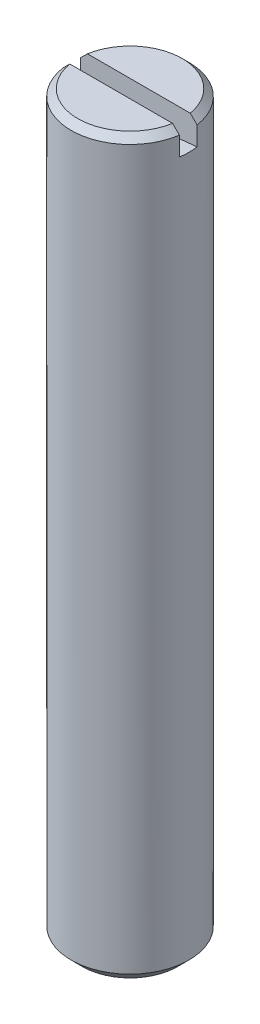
ISO-10303-21;
HEADER;
FILE_DESCRIPTION(('STEP AP214'),'2;1');
FILE_NAME('part.step','',(''),(''),'','','');
FILE_SCHEMA(('AUTOMOTIVE_DESIGN { 1 0 10303 214 1 1 1 1 }'));
ENDSEC;
DATA;
#1=APPLICATION_CONTEXT('core data for automotive mechanical design processes');
#2=APPLICATION_PROTOCOL_DEFINITION('international standard','automotive_design',2000,#1);
#3=PRODUCT_CONTEXT('',#1,'mechanical');
#4=PRODUCT('Part','Part','',(#3));
#5=PRODUCT_RELATED_PRODUCT_CATEGORY('part','',(#4));
#6=PRODUCT_DEFINITION_FORMATION('','',#4);
#7=PRODUCT_DEFINITION_CONTEXT('part definition',#1,'design');
#8=PRODUCT_DEFINITION('design','',#6,#7);
#9=PRODUCT_DEFINITION_SHAPE('','',#8);
#10=(LENGTH_UNIT() NAMED_UNIT(*) SI_UNIT(.MILLI.,.METRE.));
#11=(NAMED_UNIT(*) PLANE_ANGLE_UNIT() SI_UNIT($,.RADIAN.));
#12=(NAMED_UNIT(*) SI_UNIT($,.STERADIAN.) SOLID_ANGLE_UNIT());
#13=UNCERTAINTY_MEASURE_WITH_UNIT(LENGTH_MEASURE(1.E-05),#10,'distance_accuracy_value','');
#14=(GEOMETRIC_REPRESENTATION_CONTEXT(3) GLOBAL_UNCERTAINTY_ASSIGNED_CONTEXT((#13)) GLOBAL_UNIT_ASSIGNED_CONTEXT((#10,
#11,#12)) REPRESENTATION_CONTEXT('',''));
#15=CARTESIAN_POINT('',(0.,0.,0.));
#16=DIRECTION('',(0.,0.,1.));
#17=DIRECTION('',(1.,0.,0.));
#18=AXIS2_PLACEMENT_3D('',#15,#16,#17);
#19=CARTESIAN_POINT('',(0.,79.5,0.6));
#20=DIRECTION('',(0.,0.,-1.));
#21=DIRECTION('',(-1.,0.,0.));
#22=AXIS2_PLACEMENT_3D('',#19,#20,#21);
#23=CYLINDRICAL_SURFACE('',#22,31.5);
#24=CARTESIAN_POINT('',(3.95474398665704,48.2492400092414,-0.6));
#25=CARTESIAN_POINT('',(3.96984984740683,48.2511544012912,-0.500484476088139));
#26=CARTESIAN_POINT('',(3.98118553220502,48.2525972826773,-0.40038868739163));
#27=CARTESIAN_POINT('',(3.9962389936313,48.2545175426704,-0.20019306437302));
#28=CARTESIAN_POINT('',(4.,48.2550004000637,-0.10009653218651));
#29=CARTESIAN_POINT('',(4.,48.2550004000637,0.10009653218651));
#30=CARTESIAN_POINT('',(3.9962389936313,48.2545175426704,0.20019306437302));
#31=CARTESIAN_POINT('',(3.98118553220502,48.2525972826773,0.40038868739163));
#32=CARTESIAN_POINT('',(3.96984984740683,48.2511544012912,0.500484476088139));
#33=CARTESIAN_POINT('',(3.95474398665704,48.2492400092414,0.6));
#34=B_SPLINE_CURVE_WITH_KNOTS('',3,(#24,#25,#26,#27,#28,#29,#30,#31,#32,#33),.UNSPECIFIED.,.F.,
.F.,(4,2,2,2,4),(0.,0.301946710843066,0.602165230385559,0.902383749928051,1.20433046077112),.UNSPECIFIED.);
#35=CARTESIAN_POINT('',(3.95474398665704,48.2492400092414,-0.6));
#36=VERTEX_POINT('',#35);
#37=CARTESIAN_POINT('',(3.95474398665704,48.2492400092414,0.6));
#38=VERTEX_POINT('',#37);
#39=EDGE_CURVE('E82',#36,#38,#34,.T.);
#40=ORIENTED_EDGE('',*,*,#39,.F.);
#41=CARTESIAN_POINT('',(0.,79.5,-0.6));
#42=DIRECTION('',(0.,0.,-1.));
#43=DIRECTION('',(-1.,0.,0.));
#44=AXIS2_PLACEMENT_3D('',#41,#42,#43);
#45=CIRCLE('',#44,31.5);
#46=CARTESIAN_POINT('',(-3.95474398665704,48.2492400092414,-0.6));
#47=VERTEX_POINT('',#46);
#48=EDGE_CURVE('E88',#47,#36,#45,.F.);
#49=ORIENTED_EDGE('',*,*,#48,.F.);
#50=CARTESIAN_POINT('',(-3.95474398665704,48.2492400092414,0.6));
#51=CARTESIAN_POINT('',(-3.96984984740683,48.2511544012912,0.500484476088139));
#52=CARTESIAN_POINT('',(-3.98118553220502,48.2525972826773,0.40038868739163));
#53=CARTESIAN_POINT('',(-3.9962389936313,48.2545175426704,0.20019306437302));
#54=CARTESIAN_POINT('',(-4.,48.2550004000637,0.10009653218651));
#55=CARTESIAN_POINT('',(-4.,48.2550004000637,-0.10009653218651));
#56=CARTESIAN_POINT('',(-3.9962389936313,48.2545175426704,-0.20019306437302));
#57=CARTESIAN_POINT('',(-3.98118553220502,48.2525972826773,-0.40038868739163));
#58=CARTESIAN_POINT('',(-3.96984984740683,48.2511544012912,-0.500484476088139));
#59=CARTESIAN_POINT('',(-3.95474398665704,48.2492400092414,-0.6));
#60=B_SPLINE_CURVE_WITH_KNOTS('',3,(#50,#51,#52,#53,#54,#55,#56,#57,#58,#59),.UNSPECIFIED.,.F.,
.F.,(4,2,2,2,4),(0.,0.301946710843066,0.602165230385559,0.902383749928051,1.20433046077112),.UNSPECIFIED.);
#61=CARTESIAN_POINT('',(-3.95474398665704,48.2492400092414,0.6));
#62=VERTEX_POINT('',#61);
#63=EDGE_CURVE('E19',#62,#47,#60,.T.);
#64=ORIENTED_EDGE('',*,*,#63,.F.);
#65=CARTESIAN_POINT('',(0.,79.5,0.6));
#66=DIRECTION('',(0.,0.,-1.));
#67=DIRECTION('',(-1.,0.,0.));
#68=AXIS2_PLACEMENT_3D('',#65,#66,#67);
#69=CIRCLE('',#68,31.5);
#70=EDGE_CURVE('E81',#62,#38,#69,.F.);
#71=ORIENTED_EDGE('',*,*,#70,.T.);
#72=EDGE_LOOP('',(#40,#49,#64,#71));
#73=FACE_BOUND('',#72,.T.);
#74=ADVANCED_FACE('F15',(#73),#23,.F.);
#75=CARTESIAN_POINT('',(0.,79.5,0.6));
#76=DIRECTION('',(0.,0.,1.));
#77=DIRECTION('',(1.,0.,0.));
#78=AXIS2_PLACEMENT_3D('',#75,#76,#77);
#79=PLANE('',#78);
#80=DIRECTION('',(1.,0.,0.));
#81=VECTOR('',#80,1.);
#82=CARTESIAN_POINT('',(0.,50.,0.6));
#83=LINE('',#82,#81);
#84=CARTESIAN_POINT('',(-3.48878202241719,50.0000000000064,0.6));
#85=VERTEX_POINT('',#84);
#86=CARTESIAN_POINT('',(3.48878202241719,50.0000000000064,0.6));
#87=VERTEX_POINT('',#86);
#88=EDGE_CURVE('E157',#85,#87,#83,.T.);
#89=ORIENTED_EDGE('',*,*,#88,.T.);
#90=CARTESIAN_POINT('',(3.95474398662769,49.5399999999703,0.6));
#91=CARTESIAN_POINT('',(3.87714466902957,49.6167284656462,0.6));
#92=CARTESIAN_POINT('',(3.79951484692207,49.6934260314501,0.6));
#93=CARTESIAN_POINT('',(3.64419419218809,49.8467593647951,0.6));
#94=CARTESIAN_POINT('',(3.56650335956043,49.9233951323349,0.6));
#95=CARTESIAN_POINT('',(3.48878202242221,50.0000000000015,0.6));
#96=B_SPLINE_CURVE_WITH_KNOTS('',3,(#90,#91,#92,#93,#94,#95),.UNSPECIFIED.,.F.,.F.,(4,2,4),(0.,
0.327383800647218,0.654767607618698),.UNSPECIFIED.);
#97=CARTESIAN_POINT('',(3.95474398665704,49.5399999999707,0.6));
#98=VERTEX_POINT('',#97);
#99=EDGE_CURVE('E95',#98,#87,#96,.T.);
#100=ORIENTED_EDGE('',*,*,#99,.F.);
#101=DIRECTION('',(0.,1.,0.));
#102=VECTOR('',#101,1.);
#103=CARTESIAN_POINT('',(3.95474398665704,79.5,0.6));
#104=LINE('',#103,#102);
#105=EDGE_CURVE('E93',#38,#98,#104,.T.);
#106=ORIENTED_EDGE('',*,*,#105,.F.);
#107=ORIENTED_EDGE('',*,*,#70,.F.);
#108=DIRECTION('',(0.,1.,0.));
#109=VECTOR('',#108,1.);
#110=CARTESIAN_POINT('',(-3.95474398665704,79.5,0.6));
#111=LINE('',#110,#109);
#112=CARTESIAN_POINT('',(-3.95474398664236,49.5399999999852,0.6));
#113=VERTEX_POINT('',#112);
#114=EDGE_CURVE('E73',#113,#62,#111,.F.);
#115=ORIENTED_EDGE('',*,*,#114,.F.);
#116=CARTESIAN_POINT('',(-3.48878202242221,50.0000000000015,0.6));
#117=CARTESIAN_POINT('',(-3.56650335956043,49.9233951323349,0.6));
#118=CARTESIAN_POINT('',(-3.64419419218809,49.8467593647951,0.6));
#119=CARTESIAN_POINT('',(-3.79951484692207,49.6934260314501,0.6));
#120=CARTESIAN_POINT('',(-3.87714466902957,49.6167284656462,0.6));
#121=CARTESIAN_POINT('',(-3.95474398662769,49.5399999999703,0.6));
#122=B_SPLINE_CURVE_WITH_KNOTS('',3,(#116,#117,#118,#119,#120,#121),.UNSPECIFIED.,.F.,.F.,(4,2,
4),(0.,0.327383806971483,0.654767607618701),.UNSPECIFIED.);
#123=EDGE_CURVE('E145',#85,#113,#122,.T.);
#124=ORIENTED_EDGE('',*,*,#123,.F.);
#125=EDGE_LOOP('',(#89,#100,#106,#107,#115,#124));
#126=FACE_BOUND('',#125,.T.);
#127=ADVANCED_FACE('F91',(#126),#79,.F.);
#128=CARTESIAN_POINT('',(0.,79.5,-0.6));
#129=DIRECTION('',(0.,0.,1.));
#130=DIRECTION('',(1.,0.,0.));
#131=AXIS2_PLACEMENT_3D('',#128,#129,#130);
#132=PLANE('',#131);
#133=DIRECTION('',(1.,0.,0.));
#134=VECTOR('',#133,1.);
#135=CARTESIAN_POINT('',(0.,50.,-0.6));
#136=LINE('',#135,#134);
#137=CARTESIAN_POINT('',(3.48878202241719,50.0000000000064,-0.6));
#138=VERTEX_POINT('',#137);
#139=CARTESIAN_POINT('',(-3.48878202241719,50.0000000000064,-0.6));
#140=VERTEX_POINT('',#139);
#141=EDGE_CURVE('E159',#138,#140,#136,.F.);
#142=ORIENTED_EDGE('',*,*,#141,.T.);
#143=CARTESIAN_POINT('',(-3.48878202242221,50.0000000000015,-0.6));
#144=CARTESIAN_POINT('',(-3.56650335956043,49.9233951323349,-0.6));
#145=CARTESIAN_POINT('',(-3.64419419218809,49.8467593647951,-0.6));
#146=CARTESIAN_POINT('',(-3.79951484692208,49.6934260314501,-0.6));
#147=CARTESIAN_POINT('',(-3.87714466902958,49.6167284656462,-0.6));
#148=CARTESIAN_POINT('',(-3.9547439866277,49.5399999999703,-0.6));
#149=B_SPLINE_CURVE_WITH_KNOTS('',3,(#143,#144,#145,#146,#147,#148),.UNSPECIFIED.,.F.,.F.,(4,2,
4),(0.,0.327383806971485,0.654767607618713),.UNSPECIFIED.);
#150=CARTESIAN_POINT('',(-3.95474398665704,49.5399999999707,-0.6));
#151=VERTEX_POINT('',#150);
#152=EDGE_CURVE('E39',#140,#151,#149,.T.);
#153=ORIENTED_EDGE('',*,*,#152,.T.);
#154=DIRECTION('',(0.,1.,0.));
#155=VECTOR('',#154,1.);
#156=CARTESIAN_POINT('',(-3.95474398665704,79.5,-0.6));
#157=LINE('',#156,#155);
#158=EDGE_CURVE('E150',#151,#47,#157,.F.);
#159=ORIENTED_EDGE('',*,*,#158,.T.);
#160=ORIENTED_EDGE('',*,*,#48,.T.);
#161=DIRECTION('',(0.,1.,0.));
#162=VECTOR('',#161,1.);
#163=CARTESIAN_POINT('',(3.95474398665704,79.5,-0.6));
#164=LINE('',#163,#162);
#165=CARTESIAN_POINT('',(3.95474398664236,49.5399999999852,-0.6));
#166=VERTEX_POINT('',#165);
#167=EDGE_CURVE('E133',#36,#166,#164,.T.);
#168=ORIENTED_EDGE('',*,*,#167,.T.);
#169=CARTESIAN_POINT('',(3.95474398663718,49.5399999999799,-0.600000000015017));
#170=CARTESIAN_POINT('',(3.87714466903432,49.616728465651,-0.600000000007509));
#171=CARTESIAN_POINT('',(3.79951484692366,49.6934260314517,-0.600000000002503));
#172=CARTESIAN_POINT('',(3.64419419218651,49.8467593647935,-0.599999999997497));
#173=CARTESIAN_POINT('',(3.56650335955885,49.9233951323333,-0.599999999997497));
#174=CARTESIAN_POINT('',(3.48878202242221,50.0000000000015,-0.6));
#175=B_SPLINE_CURVE_WITH_KNOTS('',3,(#169,#170,#171,#172,#173,#174),.UNSPECIFIED.,.F.,.F.,(4,2,
4),(0.,0.327383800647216,0.654767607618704),.UNSPECIFIED.);
#176=EDGE_CURVE('E127',#166,#138,#175,.T.);
#177=ORIENTED_EDGE('',*,*,#176,.T.);
#178=EDGE_LOOP('',(#142,#153,#159,#160,#168,#177));
#179=FACE_BOUND('',#178,.T.);
#180=ADVANCED_FACE('F134',(#179),#132,.T.);
#181=CARTESIAN_POINT('',(3.233,0.,0.));
#182=DIRECTION('',(0.,1.,0.));
#183=DIRECTION('',(0.,0.,1.));
#184=AXIS2_PLACEMENT_3D('',#181,#182,#183);
#185=PLANE('',#184);
#186=CARTESIAN_POINT('',(0.,0.,0.));
#187=DIRECTION('',(0.,1.,0.));
#188=DIRECTION('',(-1.,0.,0.));
#189=AXIS2_PLACEMENT_3D('',#186,#187,#188);
#190=CIRCLE('',#189,3.23299999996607);
#191=CARTESIAN_POINT('',(-3.23299999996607,0.,0.));
#192=VERTEX_POINT('',#191);
#193=EDGE_CURVE('E163',#192,#192,#190,.T.);
#194=ORIENTED_EDGE('',*,*,#193,.F.);
#195=EDGE_LOOP('',(#194));
#196=FACE_BOUND('',#195,.T.);
#197=ADVANCED_FACE('F138',(#196),#185,.F.);
#198=CARTESIAN_POINT('',(0.,50.,0.));
#199=DIRECTION('',(0.,-1.,0.));
#200=DIRECTION('',(0.,0.,-1.));
#201=AXIS2_PLACEMENT_3D('',#198,#199,#200);
#202=PLANE('',#201);
#203=ORIENTED_EDGE('',*,*,#88,.F.);
#204=CARTESIAN_POINT('',(0.,50.0000000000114,0.));
#205=DIRECTION('',(0.,-1.,0.));
#206=DIRECTION('',(0.,0.,-1.));
#207=AXIS2_PLACEMENT_3D('',#204,#205,#206);
#208=CIRCLE('',#207,3.53999999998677);
#209=EDGE_CURVE('E155',#87,#85,#208,.T.);
#210=ORIENTED_EDGE('',*,*,#209,.F.);
#211=EDGE_LOOP('',(#203,#210));
#212=FACE_BOUND('',#211,.T.);
#213=ADVANCED_FACE('F161',(#212),#202,.F.);
#214=CARTESIAN_POINT('',(0.,50.,0.));
#215=DIRECTION('',(0.,-1.,0.));
#216=DIRECTION('',(0.,0.,-1.));
#217=AXIS2_PLACEMENT_3D('',#214,#215,#216);
#218=PLANE('',#217);
#219=CARTESIAN_POINT('',(0.,50.0000000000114,0.));
#220=DIRECTION('',(0.,-1.,0.));
#221=DIRECTION('',(0.,0.,-1.));
#222=AXIS2_PLACEMENT_3D('',#219,#220,#221);
#223=CIRCLE('',#222,3.53999999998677);
#224=EDGE_CURVE('E162',#140,#138,#223,.T.);
#225=ORIENTED_EDGE('',*,*,#224,.F.);
#226=ORIENTED_EDGE('',*,*,#141,.F.);
#227=EDGE_LOOP('',(#225,#226));
#228=FACE_BOUND('',#227,.T.);
#229=ADVANCED_FACE('F183',(#228),#218,.F.);
#230=CARTESIAN_POINT('',(0.,0.767000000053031,0.));
#231=DIRECTION('',(0.,1.,0.));
#232=DIRECTION('',(-1.,0.,0.));
#233=AXIS2_PLACEMENT_3D('',#230,#231,#232);
#234=CONICAL_SURFACE('',#233,4.0000000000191,0.785398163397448);
#235=CARTESIAN_POINT('',(0.,0.767,0.));
#236=DIRECTION('',(0.,-1.,0.));
#237=DIRECTION('',(0.,0.,-1.));
#238=AXIS2_PLACEMENT_3D('',#235,#236,#237);
#239=CIRCLE('',#238,4.);
#240=CARTESIAN_POINT('',(0.,0.767,-4.));
#241=VERTEX_POINT('',#240);
#242=EDGE_CURVE('E165',#241,#241,#239,.F.);
#243=ORIENTED_EDGE('',*,*,#242,.F.);
#244=EDGE_LOOP('',(#243));
#245=FACE_BOUND('',#244,.T.);
#246=ORIENTED_EDGE('',*,*,#193,.T.);
#247=EDGE_LOOP('',(#246));
#248=FACE_BOUND('',#247,.T.);
#249=ADVANCED_FACE('F180',(#245,#248),#234,.T.);
#250=CARTESIAN_POINT('',(0.,49.5399999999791,0.));
#251=DIRECTION('',(0.,-1.,0.));
#252=DIRECTION('',(0.,0.,-1.));
#253=AXIS2_PLACEMENT_3D('',#250,#251,#252);
#254=CONICAL_SURFACE('',#253,3.99999999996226,0.785398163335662);
#255=ORIENTED_EDGE('',*,*,#209,.T.);
#256=ORIENTED_EDGE('',*,*,#123,.T.);
#257=CARTESIAN_POINT('',(0.,49.54,0.));
#258=DIRECTION('',(0.,-1.,0.));
#259=DIRECTION('',(0.,0.,-1.));
#260=AXIS2_PLACEMENT_3D('',#257,#258,#259);
#261=CIRCLE('',#260,4.);
#262=EDGE_CURVE('E30',#98,#113,#261,.T.);
#263=ORIENTED_EDGE('',*,*,#262,.F.);
#264=ORIENTED_EDGE('',*,*,#99,.T.);
#265=EDGE_LOOP('',(#255,#256,#263,#264));
#266=FACE_BOUND('',#265,.T.);
#267=ADVANCED_FACE('F115',(#266),#254,.T.);
#268=CARTESIAN_POINT('',(0.,49.5399999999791,0.));
#269=DIRECTION('',(0.,-1.,0.));
#270=DIRECTION('',(0.,0.,-1.));
#271=AXIS2_PLACEMENT_3D('',#268,#269,#270);
#272=CONICAL_SURFACE('',#271,3.99999999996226,0.785398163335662);
#273=ORIENTED_EDGE('',*,*,#152,.F.);
#274=ORIENTED_EDGE('',*,*,#224,.T.);
#275=ORIENTED_EDGE('',*,*,#176,.F.);
#276=CARTESIAN_POINT('',(0.,49.54,0.));
#277=DIRECTION('',(0.,-1.,0.));
#278=DIRECTION('',(0.,0.,-1.));
#279=AXIS2_PLACEMENT_3D('',#276,#277,#278);
#280=CIRCLE('',#279,4.);
#281=EDGE_CURVE('E10',#151,#166,#280,.T.);
#282=ORIENTED_EDGE('',*,*,#281,.F.);
#283=EDGE_LOOP('',(#273,#274,#275,#282));
#284=FACE_BOUND('',#283,.T.);
#285=ADVANCED_FACE('F111',(#284),#272,.T.);
#286=CARTESIAN_POINT('',(0.,37.5,0.));
#287=DIRECTION('',(0.,-1.,0.));
#288=DIRECTION('',(0.,0.,-1.));
#289=AXIS2_PLACEMENT_3D('',#286,#287,#288);
#290=CYLINDRICAL_SURFACE('',#289,4.);
#291=ORIENTED_EDGE('',*,*,#39,.T.);
#292=ORIENTED_EDGE('',*,*,#105,.T.);
#293=ORIENTED_EDGE('',*,*,#262,.T.);
#294=ORIENTED_EDGE('',*,*,#114,.T.);
#295=ORIENTED_EDGE('',*,*,#63,.T.);
#296=ORIENTED_EDGE('',*,*,#158,.F.);
#297=ORIENTED_EDGE('',*,*,#281,.T.);
#298=ORIENTED_EDGE('',*,*,#167,.F.);
#299=EDGE_LOOP('',(#291,#292,#293,#294,#295,#296,#297,#298));
#300=FACE_BOUND('',#299,.T.);
#301=ORIENTED_EDGE('',*,*,#242,.T.);
#302=EDGE_LOOP('',(#301));
#303=FACE_BOUND('',#302,.T.);
#304=ADVANCED_FACE('F75',(#300,#303),#290,.T.);
#305=CLOSED_SHELL('',(#74,#127,#180,#197,#213,#229,#249,#267,#285,#304));
#306=MANIFOLD_SOLID_BREP('B1',#305);
#307=ADVANCED_BREP_SHAPE_REPRESENTATION('',(#18,#306),#14);
#308=SHAPE_DEFINITION_REPRESENTATION(#9,#307);
ENDSEC;
END-ISO-10303-21;
